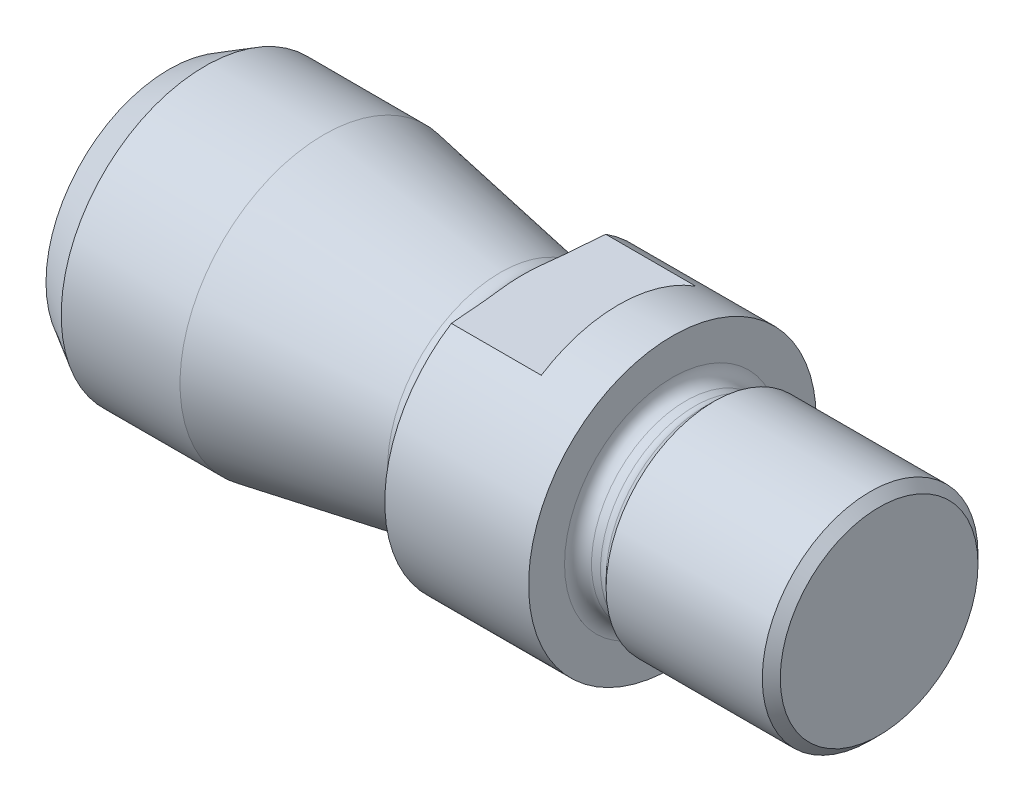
ISO-10303-21;
HEADER;
FILE_DESCRIPTION(('STEP AP214'),'2;1');
FILE_NAME('part.step','',(''),(''),'','','');
FILE_SCHEMA(('AUTOMOTIVE_DESIGN { 1 0 10303 214 1 1 1 1 }'));
ENDSEC;
DATA;
#1=APPLICATION_CONTEXT('core data for automotive mechanical design processes');
#2=APPLICATION_PROTOCOL_DEFINITION('international standard','automotive_design',2000,#1);
#3=PRODUCT_CONTEXT('',#1,'mechanical');
#4=PRODUCT('Part','Part','',(#3));
#5=PRODUCT_RELATED_PRODUCT_CATEGORY('part','',(#4));
#6=PRODUCT_DEFINITION_FORMATION('','',#4);
#7=PRODUCT_DEFINITION_CONTEXT('part definition',#1,'design');
#8=PRODUCT_DEFINITION('design','',#6,#7);
#9=PRODUCT_DEFINITION_SHAPE('','',#8);
#10=(LENGTH_UNIT() NAMED_UNIT(*) SI_UNIT(.MILLI.,.METRE.));
#11=(NAMED_UNIT(*) PLANE_ANGLE_UNIT() SI_UNIT($,.RADIAN.));
#12=(NAMED_UNIT(*) SI_UNIT($,.STERADIAN.) SOLID_ANGLE_UNIT());
#13=UNCERTAINTY_MEASURE_WITH_UNIT(LENGTH_MEASURE(1.E-05),#10,'distance_accuracy_value','');
#14=(GEOMETRIC_REPRESENTATION_CONTEXT(3) GLOBAL_UNCERTAINTY_ASSIGNED_CONTEXT((#13)) GLOBAL_UNIT_ASSIGNED_CONTEXT((#10,
#11,#12)) REPRESENTATION_CONTEXT('',''));
#15=CARTESIAN_POINT('',(0.,0.,0.));
#16=DIRECTION('',(0.,0.,1.));
#17=DIRECTION('',(1.,0.,0.));
#18=AXIS2_PLACEMENT_3D('',#15,#16,#17);
#19=CARTESIAN_POINT('',(79.,5.5,0.));
#20=DIRECTION('',(1.,0.,0.));
#21=DIRECTION('',(0.,0.,-1.));
#22=AXIS2_PLACEMENT_3D('',#19,#20,#21);
#23=PLANE('',#22);
#24=CARTESIAN_POINT('',(79.0000000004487,0.,0.));
#25=DIRECTION('',(-1.,0.,0.));
#26=DIRECTION('',(0.,0.,1.));
#27=AXIS2_PLACEMENT_3D('',#24,#25,#26);
#28=CIRCLE('',#27,11.0000000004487);
#29=CARTESIAN_POINT('',(79.0000000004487,0.,11.0000000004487));
#30=VERTEX_POINT('',#29);
#31=EDGE_CURVE('E20',#30,#30,#28,.T.);
#32=ORIENTED_EDGE('',*,*,#31,.F.);
#33=EDGE_LOOP('',(#32));
#34=FACE_BOUND('',#33,.T.);
#35=ADVANCED_FACE('F17',(#34),#23,.T.);
#36=CARTESIAN_POINT('',(77.9999999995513,0.,0.));
#37=DIRECTION('',(-1.,0.,0.));
#38=DIRECTION('',(0.,0.,1.));
#39=AXIS2_PLACEMENT_3D('',#36,#37,#38);
#40=CONICAL_SURFACE('',#39,11.9999999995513,0.78539816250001);
#41=CARTESIAN_POINT('',(78.,0.,0.));
#42=DIRECTION('',(1.,0.,0.));
#43=DIRECTION('',(0.,0.,-1.));
#44=AXIS2_PLACEMENT_3D('',#41,#42,#43);
#45=CIRCLE('',#44,12.);
#46=CARTESIAN_POINT('',(78.,0.,-12.));
#47=VERTEX_POINT('',#46);
#48=EDGE_CURVE('E285',#47,#47,#45,.F.);
#49=ORIENTED_EDGE('',*,*,#48,.F.);
#50=EDGE_LOOP('',(#49));
#51=FACE_BOUND('',#50,.T.);
#52=ORIENTED_EDGE('',*,*,#31,.T.);
#53=EDGE_LOOP('',(#52));
#54=FACE_BOUND('',#53,.T.);
#55=ADVANCED_FACE('F169',(#51,#54),#40,.T.);
#56=CARTESIAN_POINT('',(69.3106601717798,0.,0.));
#57=DIRECTION('',(1.,0.,0.));
#58=DIRECTION('',(0.,0.,-1.));
#59=AXIS2_PLACEMENT_3D('',#56,#57,#58);
#60=CYLINDRICAL_SURFACE('',#59,12.);
#61=CARTESIAN_POINT('',(60.6213203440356,0.,0.));
#62=DIRECTION('',(1.,0.,0.));
#63=DIRECTION('',(0.,1.,0.));
#64=AXIS2_PLACEMENT_3D('',#61,#62,#63);
#65=CIRCLE('',#64,11.9999999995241);
#66=CARTESIAN_POINT('',(60.6213203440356,11.9999999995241,0.));
#67=VERTEX_POINT('',#66);
#68=EDGE_CURVE('E288',#67,#67,#65,.F.);
#69=ORIENTED_EDGE('',*,*,#68,.F.);
#70=EDGE_LOOP('',(#69));
#71=FACE_BOUND('',#70,.T.);
#72=ORIENTED_EDGE('',*,*,#48,.T.);
#73=EDGE_LOOP('',(#72));
#74=FACE_BOUND('',#73,.T.);
#75=ADVANCED_FACE('F166',(#71,#74),#60,.T.);
#76=CARTESIAN_POINT('',(60.6213203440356,0.,0.));
#77=DIRECTION('',(1.,0.,0.));
#78=DIRECTION('',(0.,0.,-1.));
#79=AXIS2_PLACEMENT_3D('',#76,#77,#78);
#80=CONICAL_SURFACE('',#79,11.9999999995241,0.785398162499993);
#81=CARTESIAN_POINT('',(59.5606601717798,0.,0.));
#82=DIRECTION('',(1.,0.,0.));
#83=DIRECTION('',(0.,0.,-1.));
#84=AXIS2_PLACEMENT_3D('',#81,#82,#83);
#85=CIRCLE('',#84,10.9393398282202);
#86=CARTESIAN_POINT('',(59.5606601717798,0.,-10.9393398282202));
#87=VERTEX_POINT('',#86);
#88=EDGE_CURVE('E153',#87,#87,#85,.T.);
#89=ORIENTED_EDGE('',*,*,#88,.T.);
#90=EDGE_LOOP('',(#89));
#91=FACE_BOUND('',#90,.T.);
#92=ORIENTED_EDGE('',*,*,#68,.T.);
#93=EDGE_LOOP('',(#92));
#94=FACE_BOUND('',#93,.T.);
#95=ADVANCED_FACE('F162',(#91,#94),#80,.T.);
#96=CARTESIAN_POINT('',(58.5,0.,0.));
#97=DIRECTION('',(1.,0.,0.));
#98=DIRECTION('',(0.,0.,-1.));
#99=AXIS2_PLACEMENT_3D('',#96,#97,#98);
#100=TOROIDAL_SURFACE('',#99,12.,1.49999999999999);
#101=CARTESIAN_POINT('',(58.5,0.,0.));
#102=DIRECTION('',(1.,0.,0.));
#103=DIRECTION('',(0.,0.,-1.));
#104=AXIS2_PLACEMENT_3D('',#101,#102,#103);
#105=CIRCLE('',#104,10.5);
#106=CARTESIAN_POINT('',(58.5,0.,-10.5));
#107=VERTEX_POINT('',#106);
#108=EDGE_CURVE('E144',#107,#107,#105,.F.);
#109=ORIENTED_EDGE('',*,*,#108,.F.);
#110=EDGE_LOOP('',(#109));
#111=FACE_BOUND('',#110,.T.);
#112=ORIENTED_EDGE('',*,*,#88,.F.);
#113=EDGE_LOOP('',(#112));
#114=FACE_BOUND('',#113,.T.);
#115=ADVANCED_FACE('F159',(#111,#114),#100,.F.);
#116=CARTESIAN_POINT('',(58.,0.,0.));
#117=DIRECTION('',(1.,0.,0.));
#118=DIRECTION('',(0.,0.,-1.));
#119=AXIS2_PLACEMENT_3D('',#116,#117,#118);
#120=CYLINDRICAL_SURFACE('',#119,10.5);
#121=CARTESIAN_POINT('',(57.5,0.,0.));
#122=DIRECTION('',(1.,0.,0.));
#123=DIRECTION('',(0.,0.,-1.));
#124=AXIS2_PLACEMENT_3D('',#121,#122,#123);
#125=CIRCLE('',#124,10.5);
#126=CARTESIAN_POINT('',(57.5,0.,-10.5));
#127=VERTEX_POINT('',#126);
#128=EDGE_CURVE('E152',#127,#127,#125,.T.);
#129=ORIENTED_EDGE('',*,*,#128,.T.);
#130=EDGE_LOOP('',(#129));
#131=FACE_BOUND('',#130,.T.);
#132=ORIENTED_EDGE('',*,*,#108,.T.);
#133=EDGE_LOOP('',(#132));
#134=FACE_BOUND('',#133,.T.);
#135=ADVANCED_FACE('F135',(#131,#134),#120,.T.);
#136=CARTESIAN_POINT('',(57.5,0.,0.));
#137=DIRECTION('',(1.,0.,0.));
#138=DIRECTION('',(0.,0.,-1.));
#139=AXIS2_PLACEMENT_3D('',#136,#137,#138);
#140=TOROIDAL_SURFACE('',#139,12.,1.5);
#141=CARTESIAN_POINT('',(56.,0.,0.));
#142=DIRECTION('',(1.,0.,0.));
#143=DIRECTION('',(0.,1.,0.));
#144=AXIS2_PLACEMENT_3D('',#141,#142,#143);
#145=CIRCLE('',#144,12.);
#146=CARTESIAN_POINT('',(56.,12.,0.));
#147=VERTEX_POINT('',#146);
#148=EDGE_CURVE('E84',#147,#147,#145,.F.);
#149=ORIENTED_EDGE('',*,*,#148,.F.);
#150=EDGE_LOOP('',(#149));
#151=FACE_BOUND('',#150,.T.);
#152=ORIENTED_EDGE('',*,*,#128,.F.);
#153=EDGE_LOOP('',(#152));
#154=FACE_BOUND('',#153,.T.);
#155=ADVANCED_FACE('F130',(#151,#154),#140,.F.);
#156=CARTESIAN_POINT('',(56.,14.,0.));
#157=DIRECTION('',(1.,0.,0.));
#158=DIRECTION('',(0.,0.,-1.));
#159=AXIS2_PLACEMENT_3D('',#156,#157,#158);
#160=PLANE('',#159);
#161=ORIENTED_EDGE('',*,*,#148,.T.);
#162=EDGE_LOOP('',(#161));
#163=FACE_BOUND('',#162,.T.);
#164=CARTESIAN_POINT('',(56.,0.,0.));
#165=DIRECTION('',(1.,0.,0.));
#166=DIRECTION('',(0.,0.,-1.));
#167=AXIS2_PLACEMENT_3D('',#164,#165,#166);
#168=CIRCLE('',#167,16.);
#169=CARTESIAN_POINT('',(56.,0.,-16.));
#170=VERTEX_POINT('',#169);
#171=EDGE_CURVE('E107',#170,#170,#168,.F.);
#172=ORIENTED_EDGE('',*,*,#171,.F.);
#173=EDGE_LOOP('',(#172));
#174=FACE_BOUND('',#173,.T.);
#175=ADVANCED_FACE('F119',(#163,#174),#160,.T.);
#176=CARTESIAN_POINT('',(50.,-13.5,0.));
#177=DIRECTION('',(1.,0.,0.));
#178=DIRECTION('',(0.,0.,-1.));
#179=AXIS2_PLACEMENT_3D('',#176,#177,#178);
#180=PLANE('',#179);
#181=DIRECTION('',(0.,0.,1.));
#182=VECTOR('',#181,1.);
#183=CARTESIAN_POINT('',(50.,-13.5,0.));
#184=LINE('',#183,#182);
#185=CARTESIAN_POINT('',(50.,-13.5,8.58778201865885));
#186=VERTEX_POINT('',#185);
#187=CARTESIAN_POINT('',(50.,-13.5,-8.58778201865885));
#188=VERTEX_POINT('',#187);
#189=EDGE_CURVE('E101',#186,#188,#184,.F.);
#190=ORIENTED_EDGE('',*,*,#189,.T.);
#191=CARTESIAN_POINT('',(50.,0.,0.));
#192=DIRECTION('',(1.,0.,0.));
#193=DIRECTION('',(0.,0.,-1.));
#194=AXIS2_PLACEMENT_3D('',#191,#192,#193);
#195=CIRCLE('',#194,16.);
#196=EDGE_CURVE('E83',#186,#188,#195,.T.);
#197=ORIENTED_EDGE('',*,*,#196,.F.);
#198=EDGE_LOOP('',(#190,#197));
#199=FACE_BOUND('',#198,.T.);
#200=ADVANCED_FACE('F129',(#199),#180,.F.);
#201=CARTESIAN_POINT('',(50.,16.5,0.));
#202=DIRECTION('',(1.,0.,0.));
#203=DIRECTION('',(0.,0.,-1.));
#204=AXIS2_PLACEMENT_3D('',#201,#202,#203);
#205=PLANE('',#204);
#206=DIRECTION('',(0.,0.,-1.));
#207=VECTOR('',#206,1.);
#208=CARTESIAN_POINT('',(50.,13.5,0.));
#209=LINE('',#208,#207);
#210=CARTESIAN_POINT('',(50.,13.5,-8.58778201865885));
#211=VERTEX_POINT('',#210);
#212=CARTESIAN_POINT('',(50.,13.5,8.58778201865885));
#213=VERTEX_POINT('',#212);
#214=EDGE_CURVE('E71',#211,#213,#209,.F.);
#215=ORIENTED_EDGE('',*,*,#214,.T.);
#216=CARTESIAN_POINT('',(50.,0.,0.));
#217=DIRECTION('',(1.,0.,0.));
#218=DIRECTION('',(0.,0.,-1.));
#219=AXIS2_PLACEMENT_3D('',#216,#217,#218);
#220=CIRCLE('',#219,16.);
#221=EDGE_CURVE('E68',#211,#213,#220,.T.);
#222=ORIENTED_EDGE('',*,*,#221,.F.);
#223=EDGE_LOOP('',(#215,#222));
#224=FACE_BOUND('',#223,.T.);
#225=ADVANCED_FACE('F72',(#224),#205,.F.);
#226=CARTESIAN_POINT('',(48.,0.,0.));
#227=DIRECTION('',(1.,0.,0.));
#228=DIRECTION('',(0.,0.,-1.));
#229=AXIS2_PLACEMENT_3D('',#226,#227,#228);
#230=CYLINDRICAL_SURFACE('',#229,16.);
#231=ORIENTED_EDGE('',*,*,#171,.T.);
#232=EDGE_LOOP('',(#231));
#233=FACE_BOUND('',#232,.T.);
#234=DIRECTION('',(1.,0.,0.));
#235=VECTOR('',#234,1.);
#236=CARTESIAN_POINT('',(38.,-13.5,-8.58778201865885));
#237=LINE('',#236,#235);
#238=CARTESIAN_POINT('',(40.0000000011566,-13.5,-8.58778201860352));
#239=VERTEX_POINT('',#238);
#240=EDGE_CURVE('E100',#188,#239,#237,.F.);
#241=ORIENTED_EDGE('',*,*,#240,.T.);
#242=CARTESIAN_POINT('',(40.000000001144,0.,0.));
#243=DIRECTION('',(1.,0.,0.));
#244=DIRECTION('',(0.,1.,0.));
#245=AXIS2_PLACEMENT_3D('',#242,#243,#244);
#246=CIRCLE('',#245,15.9999999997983);
#247=CARTESIAN_POINT('',(40.000000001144,13.5,-8.58778201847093));
#248=VERTEX_POINT('',#247);
#249=EDGE_CURVE('E98',#248,#239,#246,.F.);
#250=ORIENTED_EDGE('',*,*,#249,.F.);
#251=DIRECTION('',(1.,0.,0.));
#252=VECTOR('',#251,1.);
#253=CARTESIAN_POINT('',(50.,13.5,-8.58778201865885));
#254=LINE('',#253,#252);
#255=EDGE_CURVE('E82',#248,#211,#254,.T.);
#256=ORIENTED_EDGE('',*,*,#255,.T.);
#257=ORIENTED_EDGE('',*,*,#221,.T.);
#258=DIRECTION('',(1.,0.,0.));
#259=VECTOR('',#258,1.);
#260=CARTESIAN_POINT('',(50.,13.5,8.58778201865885));
#261=LINE('',#260,#259);
#262=CARTESIAN_POINT('',(40.0000000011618,13.5,8.58778201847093));
#263=VERTEX_POINT('',#262);
#264=EDGE_CURVE('E76',#213,#263,#261,.F.);
#265=ORIENTED_EDGE('',*,*,#264,.T.);
#266=CARTESIAN_POINT('',(40.000000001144,0.,0.));
#267=DIRECTION('',(1.,0.,0.));
#268=DIRECTION('',(0.,1.,0.));
#269=AXIS2_PLACEMENT_3D('',#266,#267,#268);
#270=CIRCLE('',#269,15.9999999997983);
#271=CARTESIAN_POINT('',(40.000000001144,-13.5,8.58778201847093));
#272=VERTEX_POINT('',#271);
#273=EDGE_CURVE('E105',#272,#263,#270,.F.);
#274=ORIENTED_EDGE('',*,*,#273,.F.);
#275=DIRECTION('',(1.,0.,0.));
#276=VECTOR('',#275,1.);
#277=CARTESIAN_POINT('',(38.,-13.5,8.58778201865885));
#278=LINE('',#277,#276);
#279=EDGE_CURVE('E95',#272,#186,#278,.T.);
#280=ORIENTED_EDGE('',*,*,#279,.T.);
#281=ORIENTED_EDGE('',*,*,#196,.T.);
#282=EDGE_LOOP('',(#241,#250,#256,#257,#265,#274,#280,#281));
#283=FACE_BOUND('',#282,.T.);
#284=ADVANCED_FACE('F80',(#233,#283),#230,.T.);
#285=CARTESIAN_POINT('',(0.,6.84529946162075,0.));
#286=DIRECTION('',(-1.,0.,0.));
#287=DIRECTION('',(0.,0.,1.));
#288=AXIS2_PLACEMENT_3D('',#285,#286,#287);
#289=PLANE('',#288);
#290=CARTESIAN_POINT('',(-6.90855359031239E-10,0.,0.));
#291=DIRECTION('',(1.,0.,0.));
#292=DIRECTION('',(0.,0.,-1.));
#293=AXIS2_PLACEMENT_3D('',#290,#291,#292);
#294=CIRCLE('',#293,13.6905989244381);
#295=CARTESIAN_POINT('',(-6.90855359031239E-10,0.,-13.6905989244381));
#296=VERTEX_POINT('',#295);
#297=EDGE_CURVE('E210',#296,#296,#294,.T.);
#298=ORIENTED_EDGE('',*,*,#297,.F.);
#299=EDGE_LOOP('',(#298));
#300=FACE_BOUND('',#299,.T.);
#301=ADVANCED_FACE('F254',(#300),#289,.T.);
#302=CARTESIAN_POINT('',(40.000000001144,0.,0.));
#303=DIRECTION('',(1.,0.,0.));
#304=DIRECTION('',(0.,0.,-1.));
#305=AXIS2_PLACEMENT_3D('',#302,#303,#304);
#306=CONICAL_SURFACE('',#305,15.9999999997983,1.3962634);
#307=CARTESIAN_POINT('',(39.7471258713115,-13.499999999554,5.46944670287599));
#308=CARTESIAN_POINT('',(39.7643508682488,-13.499999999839,5.72960811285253));
#309=CARTESIAN_POINT('',(39.782627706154,-13.4999999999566,5.98969879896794));
#310=CARTESIAN_POINT('',(39.8211492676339,-13.5000000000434,6.50972152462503));
#311=CARTESIAN_POINT('',(39.8413938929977,-13.5000000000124,6.76965357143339));
#312=CARTESIAN_POINT('',(39.8837168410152,-13.4999999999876,7.28936608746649));
#313=CARTESIAN_POINT('',(39.9057951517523,-13.4999999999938,7.54914655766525));
#314=CARTESIAN_POINT('',(39.9516541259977,-13.5000000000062,8.06857040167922));
#315=CARTESIAN_POINT('',(39.975434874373,-13.5000000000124,8.3282137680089));
#316=CARTESIAN_POINT('',(40.0000000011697,-13.5,8.58778201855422));
#317=B_SPLINE_CURVE_WITH_KNOTS('',3,(#307,#308,#309,#310,#311,#312,#313,#314,#315,#316),
.UNSPECIFIED.,.F.,.F.,(4,2,2,2,4),(0.,0.782189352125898,1.56433968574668,2.34648493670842,
3.12866920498),.UNSPECIFIED.);
#318=CARTESIAN_POINT('',(39.7471258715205,-13.5,5.46944670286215));
#319=VERTEX_POINT('',#318);
#320=EDGE_CURVE('E99',#319,#272,#317,.T.);
#321=ORIENTED_EDGE('',*,*,#320,.T.);
#322=ORIENTED_EDGE('',*,*,#273,.T.);
#323=CARTESIAN_POINT('',(40.0000000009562,13.5000000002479,8.58778201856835));
#324=CARTESIAN_POINT('',(39.9754348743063,13.5000000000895,8.32821376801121));
#325=CARTESIAN_POINT('',(39.951654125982,13.5000000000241,8.06857040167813));
#326=CARTESIAN_POINT('',(39.9057951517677,13.4999999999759,7.54914655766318));
#327=CARTESIAN_POINT('',(39.8837168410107,13.4999999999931,7.28936608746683));
#328=CARTESIAN_POINT('',(39.8413938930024,13.5000000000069,6.76965357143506));
#329=CARTESIAN_POINT('',(39.821149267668,13.5000000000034,6.50972152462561));
#330=CARTESIAN_POINT('',(39.7826277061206,13.4999999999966,5.98969879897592));
#331=CARTESIAN_POINT('',(39.7643508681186,13.4999999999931,5.72960811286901));
#332=CARTESIAN_POINT('',(39.7471258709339,13.5,5.46944670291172));
#333=B_SPLINE_CURVE_WITH_KNOTS('',3,(#323,#324,#325,#326,#327,#328,#329,#330,#331,#332),
.UNSPECIFIED.,.F.,.F.,(4,2,2,2,4),(0.,0.78218426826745,1.5643295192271,2.3464798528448,
3.12866920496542),.UNSPECIFIED.);
#334=CARTESIAN_POINT('',(39.7471258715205,13.5,5.46944670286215));
#335=VERTEX_POINT('',#334);
#336=EDGE_CURVE('E88',#263,#335,#333,.T.);
#337=ORIENTED_EDGE('',*,*,#336,.T.);
#338=CARTESIAN_POINT('',(39.7471258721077,0.,0.));
#339=DIRECTION('',(1.,0.,0.));
#340=DIRECTION('',(0.,0.,-1.));
#341=AXIS2_PLACEMENT_3D('',#338,#339,#340);
#342=CIRCLE('',#341,14.5658795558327);
#343=EDGE_CURVE('E209',#335,#319,#342,.T.);
#344=ORIENTED_EDGE('',*,*,#343,.T.);
#345=EDGE_LOOP('',(#321,#322,#337,#344));
#346=FACE_BOUND('',#345,.T.);
#347=ADVANCED_FACE('F250',(#346),#306,.T.);
#348=CARTESIAN_POINT('',(38.,-13.5,0.));
#349=DIRECTION('',(0.,1.,0.));
#350=DIRECTION('',(0.,0.,1.));
#351=AXIS2_PLACEMENT_3D('',#348,#349,#350);
#352=PLANE('',#351);
#353=ORIENTED_EDGE('',*,*,#320,.F.);
#354=CARTESIAN_POINT('',(39.7471258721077,-13.5,5.46944670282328));
#355=CARTESIAN_POINT('',(39.7333362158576,-13.5,5.2613093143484));
#356=CARTESIAN_POINT('',(39.7164216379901,-13.5,5.05342551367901));
#357=CARTESIAN_POINT('',(39.6781842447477,-13.5,4.63761954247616));
#358=CARTESIAN_POINT('',(39.6568523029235,-13.5,4.42969819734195));
#359=CARTESIAN_POINT('',(39.6116591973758,-13.5,4.01380942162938));
#360=CARTESIAN_POINT('',(39.5877940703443,-13.5,3.80584244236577));
#361=CARTESIAN_POINT('',(39.5394214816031,-13.5,3.38982186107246));
#362=CARTESIAN_POINT('',(39.5149135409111,-13.5,3.18176831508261));
#363=CARTESIAN_POINT('',(39.4673180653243,-13.5,2.76686107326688));
#364=CARTESIAN_POINT('',(39.4442223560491,-13.5,2.56000833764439));
#365=CARTESIAN_POINT('',(39.4011233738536,-13.5,2.14615490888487));
#366=CARTESIAN_POINT('',(39.3811174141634,-13.5,1.93915450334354));
#367=CARTESIAN_POINT('',(39.3458901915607,-13.5,1.52499084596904));
#368=CARTESIAN_POINT('',(39.3306630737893,-13.5,1.31782810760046));
#369=CARTESIAN_POINT('',(39.3063598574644,-13.5,0.903361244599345));
#370=CARTESIAN_POINT('',(39.2972770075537,-13.5000000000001,0.696057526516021));
#371=CARTESIAN_POINT('',(39.2850522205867,-13.5000000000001,0.24087933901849));
#372=CARTESIAN_POINT('',(39.2834106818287,-13.5,-0.00703835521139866));
#373=CARTESIAN_POINT('',(39.290409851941,-13.5,-0.502954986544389));
#374=CARTESIAN_POINT('',(39.2990603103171,-13.5,-0.750953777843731));
#375=CARTESIAN_POINT('',(39.3254601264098,-13.5,-1.24683486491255));
#376=CARTESIAN_POINT('',(39.343223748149,-13.5,-1.4947163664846));
#377=CARTESIAN_POINT('',(39.3855583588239,-13.5,-1.99024171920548));
#378=CARTESIAN_POINT('',(39.4101393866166,-13.5,-2.23788467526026));
#379=CARTESIAN_POINT('',(39.4633564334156,-13.5,-2.73463906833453));
#380=CARTESIAN_POINT('',(39.4920220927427,-13.5,-2.98374720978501));
#381=CARTESIAN_POINT('',(39.5500141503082,-13.5,-3.48163766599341));
#382=CARTESIAN_POINT('',(39.579339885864,-13.5,-3.73042006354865));
#383=CARTESIAN_POINT('',(39.635387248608,-13.5,-4.22768423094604));
#384=CARTESIAN_POINT('',(39.6621150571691,-13.5,-4.47616525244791));
#385=CARTESIAN_POINT('',(39.7097396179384,-13.5,-4.97278674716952));
#386=CARTESIAN_POINT('',(39.730656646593,-13.5,-5.22092531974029));
#387=CARTESIAN_POINT('',(39.7471258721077,-13.5,-5.46944670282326));
#388=B_SPLINE_CURVE_WITH_KNOTS('',3,(#354,#355,#356,#357,#358,#359,#360,#361,#362,#363,#364,
#365,#366,#367,#368,#369,#370,#371,#372,#373,#374,#375,#376,#377,#378,#379,#380,#381,#382,#383,
#384,#385,#386,#387),.UNSPECIFIED.,.F.,.F.,(4,2,2,2,2,2,2,2,2,2,2,2,2,2,2,2,4),(0.,
0.625692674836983,1.25269118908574,1.88068555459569,2.50916195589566,3.13356625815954,
3.7574244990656,4.38051540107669,5.00292053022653,5.74646781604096,6.4907200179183,
7.23614070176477,7.98266492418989,8.73491186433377,9.48643459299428,10.2361230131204,
10.983161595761),.UNSPECIFIED.);
#389=CARTESIAN_POINT('',(39.7471258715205,-13.5,-5.46944670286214));
#390=VERTEX_POINT('',#389);
#391=EDGE_CURVE('E208',#319,#390,#388,.T.);
#392=ORIENTED_EDGE('',*,*,#391,.T.);
#393=CARTESIAN_POINT('',(40.0000000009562,-13.5000000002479,-8.58778201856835));
#394=CARTESIAN_POINT('',(39.9754348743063,-13.5000000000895,-8.32821376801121));
#395=CARTESIAN_POINT('',(39.951654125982,-13.5000000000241,-8.06857040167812));
#396=CARTESIAN_POINT('',(39.9057951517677,-13.4999999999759,-7.54914655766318));
#397=CARTESIAN_POINT('',(39.8837168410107,-13.4999999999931,-7.28936608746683));
#398=CARTESIAN_POINT('',(39.8413938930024,-13.5000000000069,-6.76965357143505));
#399=CARTESIAN_POINT('',(39.821149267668,-13.5000000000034,-6.50972152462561));
#400=CARTESIAN_POINT('',(39.7826277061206,-13.4999999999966,-5.98969879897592));
#401=CARTESIAN_POINT('',(39.7643508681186,-13.4999999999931,-5.729608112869));
#402=CARTESIAN_POINT('',(39.7471258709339,-13.5,-5.46944670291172));
#403=B_SPLINE_CURVE_WITH_KNOTS('',3,(#393,#394,#395,#396,#397,#398,#399,#400,#401,#402),
.UNSPECIFIED.,.F.,.F.,(4,2,2,2,4),(0.,0.782184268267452,1.5643295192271,2.3464798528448,
3.12866920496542),.UNSPECIFIED.);
#404=EDGE_CURVE('E77',#239,#390,#403,.T.);
#405=ORIENTED_EDGE('',*,*,#404,.F.);
#406=ORIENTED_EDGE('',*,*,#240,.F.);
#407=ORIENTED_EDGE('',*,*,#189,.F.);
#408=ORIENTED_EDGE('',*,*,#279,.F.);
#409=EDGE_LOOP('',(#353,#392,#405,#406,#407,#408));
#410=FACE_BOUND('',#409,.T.);
#411=ADVANCED_FACE('F238',(#410),#352,.F.);
#412=CARTESIAN_POINT('',(40.000000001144,0.,0.));
#413=DIRECTION('',(1.,0.,0.));
#414=DIRECTION('',(0.,0.,-1.));
#415=AXIS2_PLACEMENT_3D('',#412,#413,#414);
#416=CONICAL_SURFACE('',#415,15.9999999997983,1.3962634);
#417=ORIENTED_EDGE('',*,*,#404,.T.);
#418=CARTESIAN_POINT('',(39.7471258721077,0.,0.));
#419=DIRECTION('',(1.,0.,0.));
#420=DIRECTION('',(0.,0.,-1.));
#421=AXIS2_PLACEMENT_3D('',#418,#419,#420);
#422=CIRCLE('',#421,14.5658795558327);
#423=CARTESIAN_POINT('',(39.7471258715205,13.5,-5.46944670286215));
#424=VERTEX_POINT('',#423);
#425=EDGE_CURVE('E35',#390,#424,#422,.T.);
#426=ORIENTED_EDGE('',*,*,#425,.T.);
#427=CARTESIAN_POINT('',(39.7471258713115,13.499999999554,-5.46944670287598));
#428=CARTESIAN_POINT('',(39.7643508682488,13.499999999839,-5.72960811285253));
#429=CARTESIAN_POINT('',(39.782627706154,13.4999999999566,-5.98969879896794));
#430=CARTESIAN_POINT('',(39.8211492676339,13.5000000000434,-6.50972152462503));
#431=CARTESIAN_POINT('',(39.8413938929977,13.5000000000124,-6.76965357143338));
#432=CARTESIAN_POINT('',(39.8837168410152,13.4999999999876,-7.28936608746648));
#433=CARTESIAN_POINT('',(39.9057951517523,13.4999999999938,-7.54914655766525));
#434=CARTESIAN_POINT('',(39.9516541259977,13.5000000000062,-8.06857040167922));
#435=CARTESIAN_POINT('',(39.975434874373,13.5000000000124,-8.32821376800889));
#436=CARTESIAN_POINT('',(40.0000000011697,13.5,-8.58778201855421));
#437=B_SPLINE_CURVE_WITH_KNOTS('',3,(#427,#428,#429,#430,#431,#432,#433,#434,#435,#436),
.UNSPECIFIED.,.F.,.F.,(4,2,2,2,4),(0.,0.782189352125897,1.56433968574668,2.34648493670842,
3.12866920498),.UNSPECIFIED.);
#438=EDGE_CURVE('E90',#424,#248,#437,.T.);
#439=ORIENTED_EDGE('',*,*,#438,.T.);
#440=ORIENTED_EDGE('',*,*,#249,.T.);
#441=EDGE_LOOP('',(#417,#426,#439,#440));
#442=FACE_BOUND('',#441,.T.);
#443=ADVANCED_FACE('F235',(#442),#416,.T.);
#444=CARTESIAN_POINT('',(50.,13.5,0.));
#445=DIRECTION('',(0.,-1.,0.));
#446=DIRECTION('',(0.,0.,-1.));
#447=AXIS2_PLACEMENT_3D('',#444,#445,#446);
#448=PLANE('',#447);
#449=ORIENTED_EDGE('',*,*,#438,.F.);
#450=CARTESIAN_POINT('',(39.7471258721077,13.5,-5.46944670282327));
#451=CARTESIAN_POINT('',(39.7333362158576,13.5,-5.26130931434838));
#452=CARTESIAN_POINT('',(39.7164216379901,13.5,-5.05342551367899));
#453=CARTESIAN_POINT('',(39.6781842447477,13.5,-4.63761954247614));
#454=CARTESIAN_POINT('',(39.6568523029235,13.5,-4.42969819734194));
#455=CARTESIAN_POINT('',(39.6116591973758,13.5,-4.01380942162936));
#456=CARTESIAN_POINT('',(39.5877940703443,13.5,-3.80584244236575));
#457=CARTESIAN_POINT('',(39.5394214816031,13.5,-3.38982186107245));
#458=CARTESIAN_POINT('',(39.5149135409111,13.5,-3.1817683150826));
#459=CARTESIAN_POINT('',(39.4673180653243,13.5,-2.76686107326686));
#460=CARTESIAN_POINT('',(39.4442223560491,13.5,-2.56000833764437));
#461=CARTESIAN_POINT('',(39.4011233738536,13.5,-2.14615490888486));
#462=CARTESIAN_POINT('',(39.3811174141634,13.5,-1.93915450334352));
#463=CARTESIAN_POINT('',(39.3458901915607,13.5,-1.52499084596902));
#464=CARTESIAN_POINT('',(39.3306630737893,13.5,-1.31782810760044));
#465=CARTESIAN_POINT('',(39.3063598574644,13.5,-0.903361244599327));
#466=CARTESIAN_POINT('',(39.2972770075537,13.5000000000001,-0.696057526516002));
#467=CARTESIAN_POINT('',(39.2850522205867,13.5000000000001,-0.240879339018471));
#468=CARTESIAN_POINT('',(39.2834106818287,13.5,0.00703835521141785));
#469=CARTESIAN_POINT('',(39.290409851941,13.5,0.502954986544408));
#470=CARTESIAN_POINT('',(39.2990603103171,13.5,0.75095377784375));
#471=CARTESIAN_POINT('',(39.3254601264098,13.5,1.24683486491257));
#472=CARTESIAN_POINT('',(39.343223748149,13.5,1.49471636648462));
#473=CARTESIAN_POINT('',(39.3855583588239,13.5,1.9902417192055));
#474=CARTESIAN_POINT('',(39.4101393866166,13.5,2.23788467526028));
#475=CARTESIAN_POINT('',(39.4633564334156,13.5,2.73463906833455));
#476=CARTESIAN_POINT('',(39.4920220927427,13.5,2.98374720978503));
#477=CARTESIAN_POINT('',(39.5500141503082,13.5,3.48163766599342));
#478=CARTESIAN_POINT('',(39.579339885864,13.5,3.73042006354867));
#479=CARTESIAN_POINT('',(39.635387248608,13.5,4.22768423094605));
#480=CARTESIAN_POINT('',(39.6621150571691,13.5,4.47616525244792));
#481=CARTESIAN_POINT('',(39.7097396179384,13.5,4.97278674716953));
#482=CARTESIAN_POINT('',(39.730656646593,13.5,5.2209253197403));
#483=CARTESIAN_POINT('',(39.7471258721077,13.5,5.46944670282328));
#484=B_SPLINE_CURVE_WITH_KNOTS('',3,(#450,#451,#452,#453,#454,#455,#456,#457,#458,#459,#460,
#461,#462,#463,#464,#465,#466,#467,#468,#469,#470,#471,#472,#473,#474,#475,#476,#477,#478,#479,
#480,#481,#482,#483),.UNSPECIFIED.,.F.,.F.,(4,2,2,2,2,2,2,2,2,2,2,2,2,2,2,2,4),(0.,
0.625692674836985,1.25269118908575,1.88068555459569,2.50916195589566,3.13356625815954,
3.75742449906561,4.3805154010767,5.00292053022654,5.74646781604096,6.49072001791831,
7.23614070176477,7.9826649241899,8.73491186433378,9.48643459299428,10.2361230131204,
10.983161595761),.UNSPECIFIED.);
#485=EDGE_CURVE('E207',#424,#335,#484,.T.);
#486=ORIENTED_EDGE('',*,*,#485,.T.);
#487=ORIENTED_EDGE('',*,*,#336,.F.);
#488=ORIENTED_EDGE('',*,*,#264,.F.);
#489=ORIENTED_EDGE('',*,*,#214,.F.);
#490=ORIENTED_EDGE('',*,*,#255,.F.);
#491=EDGE_LOOP('',(#449,#486,#487,#488,#489,#490));
#492=FACE_BOUND('',#491,.T.);
#493=ADVANCED_FACE('F86',(#492),#448,.F.);
#494=CARTESIAN_POINT('',(4.00000000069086,0.,0.));
#495=DIRECTION('',(1.,0.,0.));
#496=DIRECTION('',(0.,0.,-1.));
#497=AXIS2_PLACEMENT_3D('',#494,#495,#496);
#498=CONICAL_SURFACE('',#497,15.9999999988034,0.523598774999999);
#499=ORIENTED_EDGE('',*,*,#297,.T.);
#500=EDGE_LOOP('',(#499));
#501=FACE_BOUND('',#500,.T.);
#502=CARTESIAN_POINT('',(4.,0.,0.));
#503=DIRECTION('',(1.,0.,0.));
#504=DIRECTION('',(0.,0.,-1.));
#505=AXIS2_PLACEMENT_3D('',#502,#503,#504);
#506=CIRCLE('',#505,16.);
#507=CARTESIAN_POINT('',(4.,0.,-16.));
#508=VERTEX_POINT('',#507);
#509=EDGE_CURVE('E277',#508,#508,#506,.T.);
#510=ORIENTED_EDGE('',*,*,#509,.F.);
#511=EDGE_LOOP('',(#510));
#512=FACE_BOUND('',#511,.T.);
#513=ADVANCED_FACE('F197',(#501,#512),#498,.T.);
#514=CARTESIAN_POINT('',(37.2851064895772,0.,0.));
#515=DIRECTION('',(1.,0.,0.));
#516=DIRECTION('',(0.,0.,-1.));
#517=AXIS2_PLACEMENT_3D('',#514,#515,#516);
#518=TOROIDAL_SURFACE('',#517,15.,2.5);
#519=ORIENTED_EDGE('',*,*,#425,.F.);
#520=ORIENTED_EDGE('',*,*,#391,.F.);
#521=ORIENTED_EDGE('',*,*,#343,.F.);
#522=ORIENTED_EDGE('',*,*,#485,.F.);
#523=EDGE_LOOP('',(#519,#520,#521,#522));
#524=FACE_BOUND('',#523,.T.);
#525=CARTESIAN_POINT('',(36.8509860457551,0.,0.));
#526=DIRECTION('',(-1.,0.,0.));
#527=DIRECTION('',(0.,1.,0.));
#528=AXIS2_PLACEMENT_3D('',#525,#526,#527);
#529=CIRCLE('',#528,12.5379806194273);
#530=CARTESIAN_POINT('',(36.8509860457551,12.5379806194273,0.));
#531=VERTEX_POINT('',#530);
#532=EDGE_CURVE('E26',#531,#531,#529,.T.);
#533=ORIENTED_EDGE('',*,*,#532,.F.);
#534=EDGE_LOOP('',(#533));
#535=FACE_BOUND('',#534,.T.);
#536=ADVANCED_FACE('F188',(#524,#535),#518,.F.);
#537=CARTESIAN_POINT('',(10.6084492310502,0.,0.));
#538=DIRECTION('',(1.,0.,0.));
#539=DIRECTION('',(0.,0.,-1.));
#540=AXIS2_PLACEMENT_3D('',#537,#538,#539);
#541=CYLINDRICAL_SURFACE('',#540,16.);
#542=ORIENTED_EDGE('',*,*,#509,.T.);
#543=EDGE_LOOP('',(#542));
#544=FACE_BOUND('',#543,.T.);
#545=CARTESIAN_POINT('',(17.2168984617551,0.,0.));
#546=DIRECTION('',(-1.,0.,0.));
#547=DIRECTION('',(0.,1.,0.));
#548=AXIS2_PLACEMENT_3D('',#545,#546,#547);
#549=CIRCLE('',#548,15.9999999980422);
#550=CARTESIAN_POINT('',(17.2168984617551,15.9999999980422,0.));
#551=VERTEX_POINT('',#550);
#552=EDGE_CURVE('E11',#551,#551,#549,.F.);
#553=ORIENTED_EDGE('',*,*,#552,.F.);
#554=EDGE_LOOP('',(#553));
#555=FACE_BOUND('',#554,.T.);
#556=ADVANCED_FACE('F182',(#544,#555),#541,.T.);
#557=CARTESIAN_POINT('',(17.2168984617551,0.,0.));
#558=DIRECTION('',(-1.,0.,0.));
#559=DIRECTION('',(0.,0.,1.));
#560=AXIS2_PLACEMENT_3D('',#557,#558,#559);
#561=CONICAL_SURFACE('',#560,15.9999999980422,0.174532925);
#562=ORIENTED_EDGE('',*,*,#552,.T.);
#563=EDGE_LOOP('',(#562));
#564=FACE_BOUND('',#563,.T.);
#565=ORIENTED_EDGE('',*,*,#532,.T.);
#566=EDGE_LOOP('',(#565));
#567=FACE_BOUND('',#566,.T.);
#568=ADVANCED_FACE('F180',(#564,#567),#561,.T.);
#569=CLOSED_SHELL('',(#35,#55,#75,#95,#115,#135,#155,#175,#200,#225,#284,#301,#347,#411,#443,
#493,#513,#536,#556,#568));
#570=MANIFOLD_SOLID_BREP('B1',#569);
#571=ADVANCED_BREP_SHAPE_REPRESENTATION('',(#18,#570),#14);
#572=SHAPE_DEFINITION_REPRESENTATION(#9,#571);
ENDSEC;
END-ISO-10303-21;
